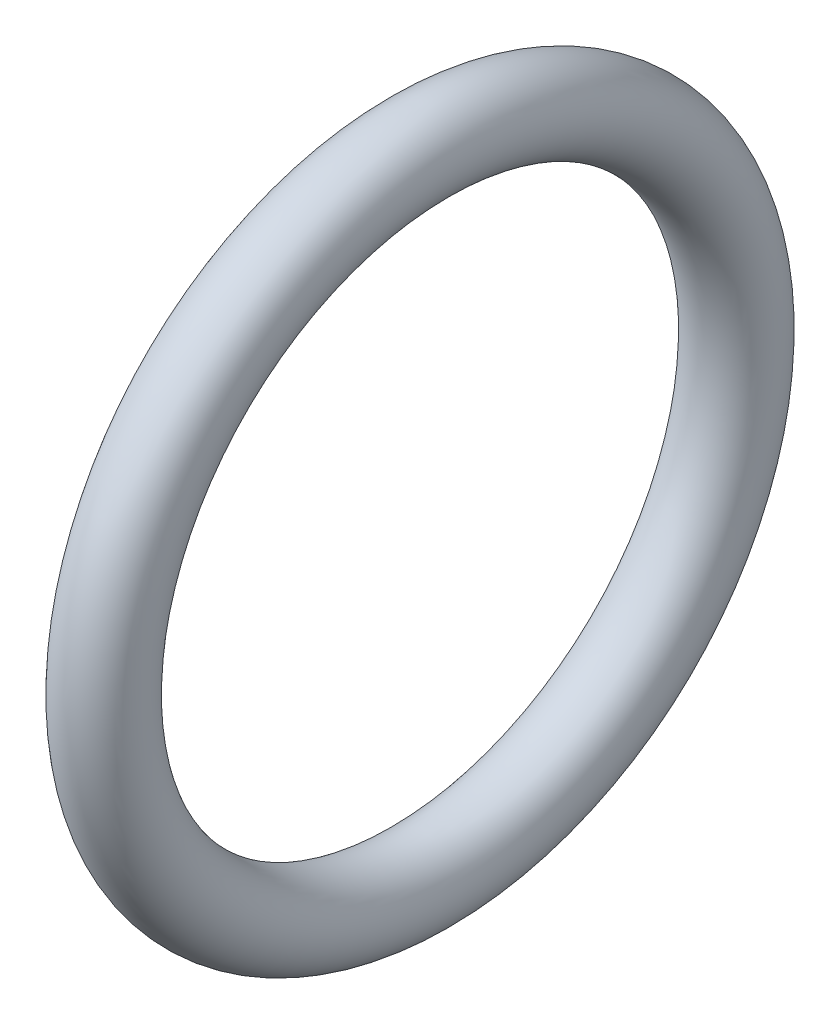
from build123d import *

# Parameters (mm, degrees)
ESQUISSE2_R = 0.445197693


with BuildPart() as part:
    # Esquisse2 → Base-R_volution (revolve)
    with BuildSketch(Plane.XY, mode=Mode.PRIVATE) as base_r_volution_sk:
        with Locations((25.654802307, 3.445197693)):
            Circle(ESQUISSE2_R)
    revolve(base_r_volution_sk.sketch.rotate(Axis((24.129178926, 0, 0), (1, 0, 0)), 180), axis=Axis((24.129178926, 0, 0), (1, 0, 0)))


solid = part.part
